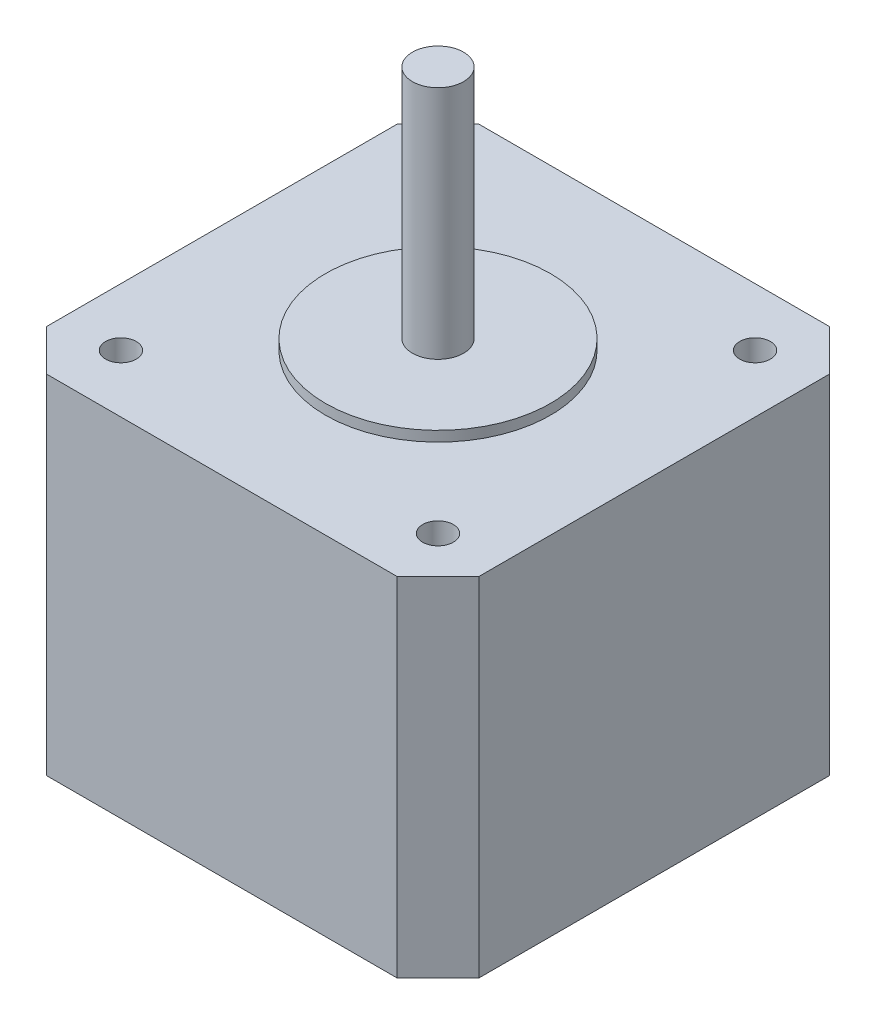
from build123d import *

# Parameters (mm, degrees)
SKETCH1_W           = 42.3
SKETCH1_H           = 42.3
BOSS_EXTRUDE1_DEPTH = 34
SKETCH2_R           = 1.5
CUT_EXTRUDE1_DEPTH  = 4.5
CHAMFER1_SIZE       = 4
SKETCH3_R           = 11
BOSS_EXTRUDE3_DEPTH = 1
SKETCH5_R           = 2.5
BOSS_EXTRUDE4_DEPTH = 23


with BuildPart() as part:
    # Sketch1 → Boss-Extrude1 (new body)
    with BuildSketch(Plane(origin=(0, 0, 0), x_dir=(1, 0, 0), z_dir=(0, 1, 0))):
        with Locations((21.15, 21.15)):
            Rectangle(SKETCH1_W, SKETCH1_H)
    extrude(amount=BOSS_EXTRUDE1_DEPTH)

    # Sketch2 → Cut-Extrude1 (cut)
    with BuildSketch(Plane(origin=(0, 34, 0), x_dir=(1, 0, 0), z_dir=(0, 1, 0))):
        with Locations(Location((36.649999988, 36.65, 0), (0, 0, 270))):
            Circle(SKETCH2_R)
        with Locations(Location((5.650000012, 36.65, 0), (0, 0, 270))):
            Circle(SKETCH2_R)
        with Locations(Location((5.650000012, 5.65, 0), (0, 0, 270))):
            Circle(SKETCH2_R)
        with Locations(Location((36.649999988, 5.65, 0), (0, 0, 270))):
            Circle(SKETCH2_R)
    extrude(amount=-CUT_EXTRUDE1_DEPTH, mode=Mode.SUBTRACT)

    # Chamfer1
    chamfer1_edges = [part.edges().sort_by_distance(p)[0] for p in [
        (0, 17, -42.3),
        (42.3, 17, -42.3),
        (42.3, 17, 0),
        (0, 17, 0),
    ]]
    chamfer(chamfer1_edges, length=CHAMFER1_SIZE)

    # Sketch3 → Boss-Extrude3 (add)
    with BuildSketch(Plane(origin=(0, 34, 0), x_dir=(1, 0, 0), z_dir=(0, 1, 0))):
        with Locations(Location((21.15, 21.15, 0), (0, 0, 270))):
            Circle(SKETCH3_R)
    extrude(amount=BOSS_EXTRUDE3_DEPTH)

    # Sketch5 → Boss-Extrude4 (add)
    with BuildSketch(Plane(origin=(0, 35, 0), x_dir=(1, 0, 0), z_dir=(0, 1, 0))):
        with Locations(Location((21.15, 21.15, 0), (0, 0, 270))):
            Circle(SKETCH5_R)
    extrude(amount=BOSS_EXTRUDE4_DEPTH)


solid = part.part
